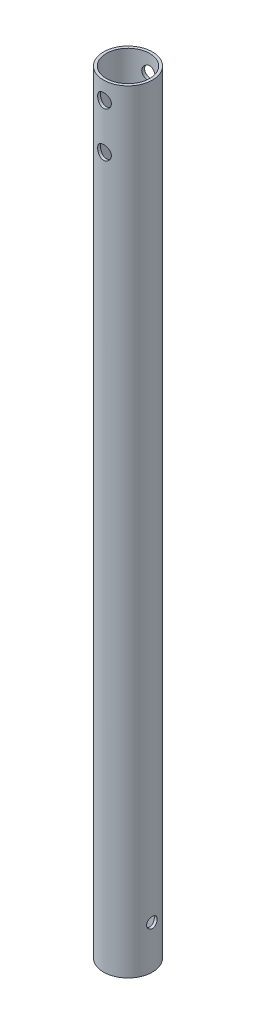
from build123d import *

# Parameters (mm, degrees)
ESQUISSE1_R                  = 6.25
ESQUISSE1_R_2                = 5.55
EXTRU_MINCE1_DEPTH           = 197.5
ENL_V_MAT_EXTRU_1_DEPTH      = 10
ENL_V_MAT_EXTRU_1_DEPTH_BACK = 10
ESQUISSE2_R                  = 1.75
ESQUISSE3_R                  = 1.35
ENL_V_MAT_EXTRU_2_DEPTH      = 10


with BuildPart() as part:
    # Esquisse1 → Extru.-Mince1 (new body)
    with BuildSketch(Plane(origin=(0, 0, 0), x_dir=(1, 0, 0), z_dir=(0, 1, 0))):
        Circle(ESQUISSE1_R)
        Circle(ESQUISSE1_R_2, mode=Mode.SUBTRACT)
    extrude(amount=EXTRU_MINCE1_DEPTH)

    # Esquisse2 → Enl_v. mat.-Extru.1 (cut, two sides: drawn at the far end of the back side and taken through both)
    with BuildSketch(Plane.XY.offset(-ENL_V_MAT_EXTRU_1_DEPTH_BACK)):
        with Locations(Location((0, 193, 0), (0, 0, 180))):
            Circle(ESQUISSE2_R)
        with Locations(Location((0, 181.5, 0), (0, 0, 180))):
            Circle(ESQUISSE2_R)
    extrude(amount=ENL_V_MAT_EXTRU_1_DEPTH + ENL_V_MAT_EXTRU_1_DEPTH_BACK, mode=Mode.SUBTRACT)

    # Esquisse3 → Enl_v. mat.-Extru.2 (cut)
    with BuildSketch(Plane(origin=(0, 0, 0), x_dir=(0, 0, -1), z_dir=(1, 0, 0))):
        with Locations(Location((0, 11, 0), (0, 0, 180))):
            Circle(ESQUISSE3_R)
    extrude(amount=ENL_V_MAT_EXTRU_2_DEPTH, mode=Mode.SUBTRACT)


solid = part.part
